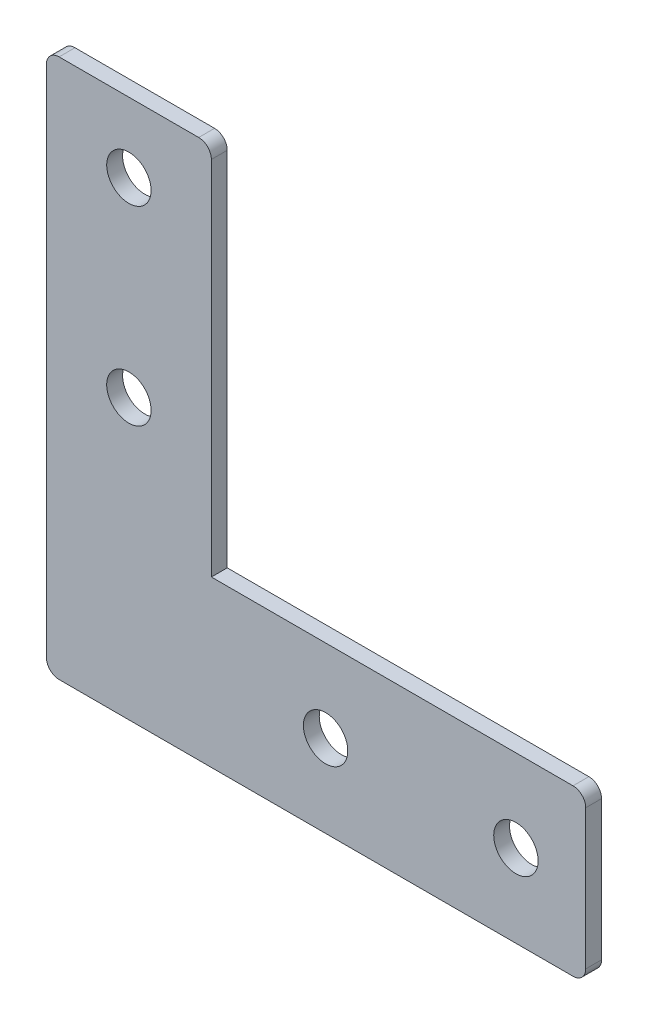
ISO-10303-21;
HEADER;
FILE_DESCRIPTION(('STEP AP214'),'2;1');
FILE_NAME('part.step','',(''),(''),'','','');
FILE_SCHEMA(('AUTOMOTIVE_DESIGN { 1 0 10303 214 1 1 1 1 }'));
ENDSEC;
DATA;
#1=APPLICATION_CONTEXT('core data for automotive mechanical design processes');
#2=APPLICATION_PROTOCOL_DEFINITION('international standard','automotive_design',2000,#1);
#3=PRODUCT_CONTEXT('',#1,'mechanical');
#4=PRODUCT('Part','Part','',(#3));
#5=PRODUCT_RELATED_PRODUCT_CATEGORY('part','',(#4));
#6=PRODUCT_DEFINITION_FORMATION('','',#4);
#7=PRODUCT_DEFINITION_CONTEXT('part definition',#1,'design');
#8=PRODUCT_DEFINITION('design','',#6,#7);
#9=PRODUCT_DEFINITION_SHAPE('','',#8);
#10=(LENGTH_UNIT() NAMED_UNIT(*) SI_UNIT(.MILLI.,.METRE.));
#11=(NAMED_UNIT(*) PLANE_ANGLE_UNIT() SI_UNIT($,.RADIAN.));
#12=(NAMED_UNIT(*) SI_UNIT($,.STERADIAN.) SOLID_ANGLE_UNIT());
#13=UNCERTAINTY_MEASURE_WITH_UNIT(LENGTH_MEASURE(1.E-05),#10,'distance_accuracy_value','');
#14=(GEOMETRIC_REPRESENTATION_CONTEXT(3) GLOBAL_UNCERTAINTY_ASSIGNED_CONTEXT((#13)) GLOBAL_UNIT_ASSIGNED_CONTEXT((#10,
#11,#12)) REPRESENTATION_CONTEXT('',''));
#15=CARTESIAN_POINT('',(0.,0.,0.));
#16=DIRECTION('',(0.,0.,1.));
#17=DIRECTION('',(1.,0.,0.));
#18=AXIS2_PLACEMENT_3D('',#15,#16,#17);
#19=CARTESIAN_POINT('',(0.,0.,1.25));
#20=DIRECTION('',(0.,0.,1.));
#21=DIRECTION('',(1.,0.,0.));
#22=AXIS2_PLACEMENT_3D('',#19,#20,#21);
#23=PLANE('',#22);
#24=CARTESIAN_POINT('',(44.,13.,1.25));
#25=DIRECTION('',(0.,0.,1.));
#26=DIRECTION('',(-1.,0.,0.));
#27=AXIS2_PLACEMENT_3D('',#24,#25,#26);
#28=CIRCLE('',#27,3.5);
#29=CARTESIAN_POINT('',(40.5,13.,1.25));
#30=VERTEX_POINT('',#29);
#31=EDGE_CURVE('E399',#30,#30,#28,.T.);
#32=ORIENTED_EDGE('',*,*,#31,.F.);
#33=EDGE_LOOP('',(#32));
#34=FACE_BOUND('',#33,.T.);
#35=CARTESIAN_POINT('',(13.,74.,1.25));
#36=DIRECTION('',(0.,0.,1.));
#37=DIRECTION('',(1.,0.,0.));
#38=AXIS2_PLACEMENT_3D('',#35,#36,#37);
#39=CIRCLE('',#38,3.5);
#40=CARTESIAN_POINT('',(16.5,74.,1.25));
#41=VERTEX_POINT('',#40);
#42=EDGE_CURVE('E150',#41,#41,#39,.T.);
#43=ORIENTED_EDGE('',*,*,#42,.F.);
#44=EDGE_LOOP('',(#43));
#45=FACE_BOUND('',#44,.T.);
#46=DIRECTION('',(1.,0.,0.));
#47=VECTOR('',#46,1.);
#48=CARTESIAN_POINT('',(0.,0.,1.25));
#49=LINE('',#48,#47);
#50=CARTESIAN_POINT('',(2.,0.,1.25));
#51=VERTEX_POINT('',#50);
#52=CARTESIAN_POINT('',(83.,0.,1.25));
#53=VERTEX_POINT('',#52);
#54=EDGE_CURVE('E217',#51,#53,#49,.T.);
#55=ORIENTED_EDGE('',*,*,#54,.T.);
#56=CARTESIAN_POINT('',(83.,2.,1.25));
#57=DIRECTION('',(0.,0.,1.));
#58=DIRECTION('',(1.,0.,0.));
#59=AXIS2_PLACEMENT_3D('',#56,#57,#58);
#60=CIRCLE('',#59,2.);
#61=CARTESIAN_POINT('',(85.,2.,1.25));
#62=VERTEX_POINT('',#61);
#63=EDGE_CURVE('E187',#53,#62,#60,.T.);
#64=ORIENTED_EDGE('',*,*,#63,.T.);
#65=DIRECTION('',(0.,1.,0.));
#66=VECTOR('',#65,1.);
#67=CARTESIAN_POINT('',(85.,0.,1.25));
#68=LINE('',#67,#66);
#69=CARTESIAN_POINT('',(85.,24.,1.25));
#70=VERTEX_POINT('',#69);
#71=EDGE_CURVE('E127',#62,#70,#68,.T.);
#72=ORIENTED_EDGE('',*,*,#71,.T.);
#73=CARTESIAN_POINT('',(83.,24.,1.25));
#74=DIRECTION('',(0.,0.,1.));
#75=DIRECTION('',(1.,0.,0.));
#76=AXIS2_PLACEMENT_3D('',#73,#74,#75);
#77=CIRCLE('',#76,2.);
#78=CARTESIAN_POINT('',(83.,26.,1.25));
#79=VERTEX_POINT('',#78);
#80=EDGE_CURVE('E123',#70,#79,#77,.T.);
#81=ORIENTED_EDGE('',*,*,#80,.T.);
#82=DIRECTION('',(-1.,0.,0.));
#83=VECTOR('',#82,1.);
#84=CARTESIAN_POINT('',(85.,26.,1.25));
#85=LINE('',#84,#83);
#86=CARTESIAN_POINT('',(26.,26.,1.25));
#87=VERTEX_POINT('',#86);
#88=EDGE_CURVE('E115',#79,#87,#85,.T.);
#89=ORIENTED_EDGE('',*,*,#88,.T.);
#90=DIRECTION('',(0.,1.,0.));
#91=VECTOR('',#90,1.);
#92=CARTESIAN_POINT('',(26.,26.,1.25));
#93=LINE('',#92,#91);
#94=CARTESIAN_POINT('',(26.,83.,1.25));
#95=VERTEX_POINT('',#94);
#96=EDGE_CURVE('E120',#87,#95,#93,.T.);
#97=ORIENTED_EDGE('',*,*,#96,.T.);
#98=CARTESIAN_POINT('',(24.,83.,1.25));
#99=DIRECTION('',(0.,0.,1.));
#100=DIRECTION('',(1.,0.,0.));
#101=AXIS2_PLACEMENT_3D('',#98,#99,#100);
#102=CIRCLE('',#101,2.);
#103=CARTESIAN_POINT('',(24.,85.,1.25));
#104=VERTEX_POINT('',#103);
#105=EDGE_CURVE('E55',#95,#104,#102,.T.);
#106=ORIENTED_EDGE('',*,*,#105,.T.);
#107=DIRECTION('',(-1.,0.,0.));
#108=VECTOR('',#107,1.);
#109=CARTESIAN_POINT('',(26.,85.,1.25));
#110=LINE('',#109,#108);
#111=CARTESIAN_POINT('',(2.,85.,1.25));
#112=VERTEX_POINT('',#111);
#113=EDGE_CURVE('E138',#104,#112,#110,.T.);
#114=ORIENTED_EDGE('',*,*,#113,.T.);
#115=CARTESIAN_POINT('',(2.,83.,1.25));
#116=DIRECTION('',(0.,0.,1.));
#117=DIRECTION('',(1.,0.,0.));
#118=AXIS2_PLACEMENT_3D('',#115,#116,#117);
#119=CIRCLE('',#118,2.);
#120=CARTESIAN_POINT('',(0.,83.,1.25));
#121=VERTEX_POINT('',#120);
#122=EDGE_CURVE('E182',#112,#121,#119,.T.);
#123=ORIENTED_EDGE('',*,*,#122,.T.);
#124=DIRECTION('',(0.,-1.,0.));
#125=VECTOR('',#124,1.);
#126=CARTESIAN_POINT('',(0.,85.,1.25));
#127=LINE('',#126,#125);
#128=CARTESIAN_POINT('',(0.,2.,1.25));
#129=VERTEX_POINT('',#128);
#130=EDGE_CURVE('E160',#121,#129,#127,.T.);
#131=ORIENTED_EDGE('',*,*,#130,.T.);
#132=CARTESIAN_POINT('',(2.,2.,1.25));
#133=DIRECTION('',(0.,0.,1.));
#134=DIRECTION('',(1.,0.,0.));
#135=AXIS2_PLACEMENT_3D('',#132,#133,#134);
#136=CIRCLE('',#135,2.);
#137=EDGE_CURVE('E184',#129,#51,#136,.T.);
#138=ORIENTED_EDGE('',*,*,#137,.T.);
#139=EDGE_LOOP('',(#55,#64,#72,#81,#89,#97,#106,#114,#123,#131,#138));
#140=FACE_BOUND('',#139,.T.);
#141=CARTESIAN_POINT('',(13.,44.,1.25));
#142=DIRECTION('',(0.,0.,1.));
#143=DIRECTION('',(1.,0.,0.));
#144=AXIS2_PLACEMENT_3D('',#141,#142,#143);
#145=CIRCLE('',#144,3.5);
#146=CARTESIAN_POINT('',(16.5,44.,1.25));
#147=VERTEX_POINT('',#146);
#148=EDGE_CURVE('E393',#147,#147,#145,.T.);
#149=ORIENTED_EDGE('',*,*,#148,.F.);
#150=EDGE_LOOP('',(#149));
#151=FACE_BOUND('',#150,.T.);
#152=CARTESIAN_POINT('',(74.,13.,1.25));
#153=DIRECTION('',(0.,0.,1.));
#154=DIRECTION('',(-1.,0.,0.));
#155=AXIS2_PLACEMENT_3D('',#152,#153,#154);
#156=CIRCLE('',#155,3.50000000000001);
#157=CARTESIAN_POINT('',(70.5,13.,1.25));
#158=VERTEX_POINT('',#157);
#159=EDGE_CURVE('E405',#158,#158,#156,.T.);
#160=ORIENTED_EDGE('',*,*,#159,.F.);
#161=EDGE_LOOP('',(#160));
#162=FACE_BOUND('',#161,.T.);
#163=ADVANCED_FACE('F34',(#34,#45,#140,#151,#162),#23,.T.);
#164=CARTESIAN_POINT('',(0.,0.,-1.25));
#165=DIRECTION('',(0.,0.,1.));
#166=DIRECTION('',(1.,0.,0.));
#167=AXIS2_PLACEMENT_3D('',#164,#165,#166);
#168=PLANE('',#167);
#169=CARTESIAN_POINT('',(44.,13.,-1.25));
#170=DIRECTION('',(0.,0.,1.));
#171=DIRECTION('',(-1.,0.,0.));
#172=AXIS2_PLACEMENT_3D('',#169,#170,#171);
#173=CIRCLE('',#172,3.5);
#174=CARTESIAN_POINT('',(40.5,13.,-1.25));
#175=VERTEX_POINT('',#174);
#176=EDGE_CURVE('E402',#175,#175,#173,.T.);
#177=ORIENTED_EDGE('',*,*,#176,.T.);
#178=EDGE_LOOP('',(#177));
#179=FACE_BOUND('',#178,.T.);
#180=CARTESIAN_POINT('',(13.,74.,-1.25));
#181=DIRECTION('',(0.,0.,1.));
#182=DIRECTION('',(1.,0.,0.));
#183=AXIS2_PLACEMENT_3D('',#180,#181,#182);
#184=CIRCLE('',#183,3.5);
#185=CARTESIAN_POINT('',(16.5,74.,-1.25));
#186=VERTEX_POINT('',#185);
#187=EDGE_CURVE('E221',#186,#186,#184,.T.);
#188=ORIENTED_EDGE('',*,*,#187,.T.);
#189=EDGE_LOOP('',(#188));
#190=FACE_BOUND('',#189,.T.);
#191=DIRECTION('',(0.,1.,0.));
#192=VECTOR('',#191,1.);
#193=CARTESIAN_POINT('',(85.,0.,-1.25));
#194=LINE('',#193,#192);
#195=CARTESIAN_POINT('',(85.,2.,-1.25));
#196=VERTEX_POINT('',#195);
#197=CARTESIAN_POINT('',(85.,24.,-1.25));
#198=VERTEX_POINT('',#197);
#199=EDGE_CURVE('E153',#196,#198,#194,.T.);
#200=ORIENTED_EDGE('',*,*,#199,.F.);
#201=CARTESIAN_POINT('',(83.,2.,-1.25));
#202=DIRECTION('',(0.,0.,1.));
#203=DIRECTION('',(1.,0.,0.));
#204=AXIS2_PLACEMENT_3D('',#201,#202,#203);
#205=CIRCLE('',#204,2.);
#206=CARTESIAN_POINT('',(83.,0.,-1.25));
#207=VERTEX_POINT('',#206);
#208=EDGE_CURVE('E174',#196,#207,#205,.F.);
#209=ORIENTED_EDGE('',*,*,#208,.T.);
#210=DIRECTION('',(1.,0.,0.));
#211=VECTOR('',#210,1.);
#212=CARTESIAN_POINT('',(0.,0.,-1.25));
#213=LINE('',#212,#211);
#214=CARTESIAN_POINT('',(2.,0.,-1.25));
#215=VERTEX_POINT('',#214);
#216=EDGE_CURVE('E149',#215,#207,#213,.T.);
#217=ORIENTED_EDGE('',*,*,#216,.F.);
#218=CARTESIAN_POINT('',(2.,2.,-1.25));
#219=DIRECTION('',(0.,0.,1.));
#220=DIRECTION('',(1.,0.,0.));
#221=AXIS2_PLACEMENT_3D('',#218,#219,#220);
#222=CIRCLE('',#221,2.);
#223=CARTESIAN_POINT('',(0.,2.,-1.25));
#224=VERTEX_POINT('',#223);
#225=EDGE_CURVE('E170',#215,#224,#222,.F.);
#226=ORIENTED_EDGE('',*,*,#225,.T.);
#227=DIRECTION('',(0.,-1.,0.));
#228=VECTOR('',#227,1.);
#229=CARTESIAN_POINT('',(0.,85.,-1.25));
#230=LINE('',#229,#228);
#231=CARTESIAN_POINT('',(0.,83.,-1.25));
#232=VERTEX_POINT('',#231);
#233=EDGE_CURVE('E146',#232,#224,#230,.T.);
#234=ORIENTED_EDGE('',*,*,#233,.F.);
#235=CARTESIAN_POINT('',(2.,83.,-1.25));
#236=DIRECTION('',(0.,0.,1.));
#237=DIRECTION('',(1.,0.,0.));
#238=AXIS2_PLACEMENT_3D('',#235,#236,#237);
#239=CIRCLE('',#238,2.);
#240=CARTESIAN_POINT('',(2.,85.,-1.25));
#241=VERTEX_POINT('',#240);
#242=EDGE_CURVE('E168',#232,#241,#239,.F.);
#243=ORIENTED_EDGE('',*,*,#242,.T.);
#244=DIRECTION('',(-1.,0.,0.));
#245=VECTOR('',#244,1.);
#246=CARTESIAN_POINT('',(26.,85.,-1.25));
#247=LINE('',#246,#245);
#248=CARTESIAN_POINT('',(24.,85.,-1.25));
#249=VERTEX_POINT('',#248);
#250=EDGE_CURVE('E159',#249,#241,#247,.T.);
#251=ORIENTED_EDGE('',*,*,#250,.F.);
#252=CARTESIAN_POINT('',(24.,83.,-1.25));
#253=DIRECTION('',(0.,0.,1.));
#254=DIRECTION('',(1.,0.,0.));
#255=AXIS2_PLACEMENT_3D('',#252,#253,#254);
#256=CIRCLE('',#255,2.);
#257=CARTESIAN_POINT('',(26.,83.,-1.25));
#258=VERTEX_POINT('',#257);
#259=EDGE_CURVE('E166',#249,#258,#256,.F.);
#260=ORIENTED_EDGE('',*,*,#259,.T.);
#261=DIRECTION('',(0.,1.,0.));
#262=VECTOR('',#261,1.);
#263=CARTESIAN_POINT('',(26.,26.,-1.25));
#264=LINE('',#263,#262);
#265=CARTESIAN_POINT('',(26.,26.,-1.25));
#266=VERTEX_POINT('',#265);
#267=EDGE_CURVE('E157',#266,#258,#264,.T.);
#268=ORIENTED_EDGE('',*,*,#267,.F.);
#269=DIRECTION('',(-1.,0.,0.));
#270=VECTOR('',#269,1.);
#271=CARTESIAN_POINT('',(85.,26.,-1.25));
#272=LINE('',#271,#270);
#273=CARTESIAN_POINT('',(83.,26.,-1.25));
#274=VERTEX_POINT('',#273);
#275=EDGE_CURVE('E133',#274,#266,#272,.T.);
#276=ORIENTED_EDGE('',*,*,#275,.F.);
#277=CARTESIAN_POINT('',(83.,24.,-1.25));
#278=DIRECTION('',(0.,0.,1.));
#279=DIRECTION('',(1.,0.,0.));
#280=AXIS2_PLACEMENT_3D('',#277,#278,#279);
#281=CIRCLE('',#280,2.);
#282=EDGE_CURVE('E172',#274,#198,#281,.F.);
#283=ORIENTED_EDGE('',*,*,#282,.T.);
#284=EDGE_LOOP('',(#200,#209,#217,#226,#234,#243,#251,#260,#268,#276,#283));
#285=FACE_BOUND('',#284,.T.);
#286=CARTESIAN_POINT('',(13.,44.,-1.25));
#287=DIRECTION('',(0.,0.,1.));
#288=DIRECTION('',(1.,0.,0.));
#289=AXIS2_PLACEMENT_3D('',#286,#287,#288);
#290=CIRCLE('',#289,3.5);
#291=CARTESIAN_POINT('',(16.5,44.,-1.25));
#292=VERTEX_POINT('',#291);
#293=EDGE_CURVE('E395',#292,#292,#290,.T.);
#294=ORIENTED_EDGE('',*,*,#293,.T.);
#295=EDGE_LOOP('',(#294));
#296=FACE_BOUND('',#295,.T.);
#297=CARTESIAN_POINT('',(74.,13.,-1.25));
#298=DIRECTION('',(0.,0.,1.));
#299=DIRECTION('',(-1.,0.,0.));
#300=AXIS2_PLACEMENT_3D('',#297,#298,#299);
#301=CIRCLE('',#300,3.50000000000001);
#302=CARTESIAN_POINT('',(70.5,13.,-1.25));
#303=VERTEX_POINT('',#302);
#304=EDGE_CURVE('E408',#303,#303,#301,.T.);
#305=ORIENTED_EDGE('',*,*,#304,.T.);
#306=EDGE_LOOP('',(#305));
#307=FACE_BOUND('',#306,.T.);
#308=ADVANCED_FACE('F204',(#179,#190,#285,#296,#307),#168,.F.);
#309=CARTESIAN_POINT('',(0.,85.,1.25));
#310=DIRECTION('',(1.,0.,0.));
#311=DIRECTION('',(0.,1.,0.));
#312=AXIS2_PLACEMENT_3D('',#309,#310,#311);
#313=PLANE('',#312);
#314=ORIENTED_EDGE('',*,*,#233,.T.);
#315=DIRECTION('',(0.,0.,-1.));
#316=VECTOR('',#315,1.);
#317=CARTESIAN_POINT('',(0.,2.,1.25));
#318=LINE('',#317,#316);
#319=EDGE_CURVE('E194',#224,#129,#318,.F.);
#320=ORIENTED_EDGE('',*,*,#319,.T.);
#321=ORIENTED_EDGE('',*,*,#130,.F.);
#322=DIRECTION('',(0.,0.,-1.));
#323=VECTOR('',#322,1.);
#324=CARTESIAN_POINT('',(0.,83.,1.25));
#325=LINE('',#324,#323);
#326=EDGE_CURVE('E191',#121,#232,#325,.T.);
#327=ORIENTED_EDGE('',*,*,#326,.T.);
#328=EDGE_LOOP('',(#314,#320,#321,#327));
#329=FACE_BOUND('',#328,.T.);
#330=ADVANCED_FACE('F213',(#329),#313,.F.);
#331=CARTESIAN_POINT('',(0.,0.,1.25));
#332=DIRECTION('',(0.,1.,0.));
#333=DIRECTION('',(0.,0.,1.));
#334=AXIS2_PLACEMENT_3D('',#331,#332,#333);
#335=PLANE('',#334);
#336=ORIENTED_EDGE('',*,*,#216,.T.);
#337=DIRECTION('',(0.,0.,-1.));
#338=VECTOR('',#337,1.);
#339=CARTESIAN_POINT('',(83.,0.,1.25));
#340=LINE('',#339,#338);
#341=EDGE_CURVE('E179',#207,#53,#340,.F.);
#342=ORIENTED_EDGE('',*,*,#341,.T.);
#343=ORIENTED_EDGE('',*,*,#54,.F.);
#344=DIRECTION('',(0.,0.,-1.));
#345=VECTOR('',#344,1.);
#346=CARTESIAN_POINT('',(2.,0.,1.25));
#347=LINE('',#346,#345);
#348=EDGE_CURVE('E176',#51,#215,#347,.T.);
#349=ORIENTED_EDGE('',*,*,#348,.T.);
#350=EDGE_LOOP('',(#336,#342,#343,#349));
#351=FACE_BOUND('',#350,.T.);
#352=ADVANCED_FACE('F259',(#351),#335,.F.);
#353=CARTESIAN_POINT('',(85.,0.,1.25));
#354=DIRECTION('',(-1.,0.,0.));
#355=DIRECTION('',(0.,0.,1.));
#356=AXIS2_PLACEMENT_3D('',#353,#354,#355);
#357=PLANE('',#356);
#358=ORIENTED_EDGE('',*,*,#71,.F.);
#359=DIRECTION('',(0.,0.,-1.));
#360=VECTOR('',#359,1.);
#361=CARTESIAN_POINT('',(85.,2.,1.25));
#362=LINE('',#361,#360);
#363=EDGE_CURVE('E163',#62,#196,#362,.T.);
#364=ORIENTED_EDGE('',*,*,#363,.T.);
#365=ORIENTED_EDGE('',*,*,#199,.T.);
#366=DIRECTION('',(0.,0.,-1.));
#367=VECTOR('',#366,1.);
#368=CARTESIAN_POINT('',(85.,24.,1.25));
#369=LINE('',#368,#367);
#370=EDGE_CURVE('E137',#198,#70,#369,.F.);
#371=ORIENTED_EDGE('',*,*,#370,.T.);
#372=EDGE_LOOP('',(#358,#364,#365,#371));
#373=FACE_BOUND('',#372,.T.);
#374=ADVANCED_FACE('F256',(#373),#357,.F.);
#375=CARTESIAN_POINT('',(85.,26.,1.25));
#376=DIRECTION('',(0.,-1.,0.));
#377=DIRECTION('',(1.,0.,0.));
#378=AXIS2_PLACEMENT_3D('',#375,#376,#377);
#379=PLANE('',#378);
#380=ORIENTED_EDGE('',*,*,#88,.F.);
#381=DIRECTION('',(0.,0.,-1.));
#382=VECTOR('',#381,1.);
#383=CARTESIAN_POINT('',(83.,26.,1.25));
#384=LINE('',#383,#382);
#385=EDGE_CURVE('E189',#79,#274,#384,.T.);
#386=ORIENTED_EDGE('',*,*,#385,.T.);
#387=ORIENTED_EDGE('',*,*,#275,.T.);
#388=DIRECTION('',(0.,0.,-1.));
#389=VECTOR('',#388,1.);
#390=CARTESIAN_POINT('',(26.,26.,1.25));
#391=LINE('',#390,#389);
#392=EDGE_CURVE('E130',#87,#266,#391,.T.);
#393=ORIENTED_EDGE('',*,*,#392,.F.);
#394=EDGE_LOOP('',(#380,#386,#387,#393));
#395=FACE_BOUND('',#394,.T.);
#396=ADVANCED_FACE('F131',(#395),#379,.F.);
#397=CARTESIAN_POINT('',(26.,26.,1.25));
#398=DIRECTION('',(-1.,0.,0.));
#399=DIRECTION('',(0.,-1.,0.));
#400=AXIS2_PLACEMENT_3D('',#397,#398,#399);
#401=PLANE('',#400);
#402=ORIENTED_EDGE('',*,*,#267,.T.);
#403=DIRECTION('',(0.,0.,-1.));
#404=VECTOR('',#403,1.);
#405=CARTESIAN_POINT('',(26.,83.,1.25));
#406=LINE('',#405,#404);
#407=EDGE_CURVE('E11',#258,#95,#406,.F.);
#408=ORIENTED_EDGE('',*,*,#407,.T.);
#409=ORIENTED_EDGE('',*,*,#96,.F.);
#410=ORIENTED_EDGE('',*,*,#392,.T.);
#411=EDGE_LOOP('',(#402,#408,#409,#410));
#412=FACE_BOUND('',#411,.T.);
#413=ADVANCED_FACE('F140',(#412),#401,.F.);
#414=CARTESIAN_POINT('',(26.,85.,1.25));
#415=DIRECTION('',(0.,-1.,0.));
#416=DIRECTION('',(0.,0.,-1.));
#417=AXIS2_PLACEMENT_3D('',#414,#415,#416);
#418=PLANE('',#417);
#419=ORIENTED_EDGE('',*,*,#250,.T.);
#420=DIRECTION('',(0.,0.,-1.));
#421=VECTOR('',#420,1.);
#422=CARTESIAN_POINT('',(2.,85.,1.25));
#423=LINE('',#422,#421);
#424=EDGE_CURVE('E42',#241,#112,#423,.F.);
#425=ORIENTED_EDGE('',*,*,#424,.T.);
#426=ORIENTED_EDGE('',*,*,#113,.F.);
#427=DIRECTION('',(0.,0.,-1.));
#428=VECTOR('',#427,1.);
#429=CARTESIAN_POINT('',(24.,85.,1.25));
#430=LINE('',#429,#428);
#431=EDGE_CURVE('E196',#104,#249,#430,.T.);
#432=ORIENTED_EDGE('',*,*,#431,.T.);
#433=EDGE_LOOP('',(#419,#425,#426,#432));
#434=FACE_BOUND('',#433,.T.);
#435=ADVANCED_FACE('F200',(#434),#418,.F.);
#436=CARTESIAN_POINT('',(13.,74.,1.25));
#437=DIRECTION('',(0.,0.,-1.));
#438=DIRECTION('',(-1.,0.,0.));
#439=AXIS2_PLACEMENT_3D('',#436,#437,#438);
#440=CYLINDRICAL_SURFACE('',#439,3.5);
#441=ORIENTED_EDGE('',*,*,#42,.T.);
#442=EDGE_LOOP('',(#441));
#443=FACE_BOUND('',#442,.T.);
#444=ORIENTED_EDGE('',*,*,#187,.F.);
#445=EDGE_LOOP('',(#444));
#446=FACE_BOUND('',#445,.T.);
#447=ADVANCED_FACE('F247',(#443,#446),#440,.F.);
#448=CARTESIAN_POINT('',(13.,44.,1.25));
#449=DIRECTION('',(0.,0.,-1.));
#450=DIRECTION('',(-1.,0.,0.));
#451=AXIS2_PLACEMENT_3D('',#448,#449,#450);
#452=CYLINDRICAL_SURFACE('',#451,3.5);
#453=ORIENTED_EDGE('',*,*,#148,.T.);
#454=EDGE_LOOP('',(#453));
#455=FACE_BOUND('',#454,.T.);
#456=ORIENTED_EDGE('',*,*,#293,.F.);
#457=EDGE_LOOP('',(#456));
#458=FACE_BOUND('',#457,.T.);
#459=ADVANCED_FACE('F319',(#455,#458),#452,.F.);
#460=CARTESIAN_POINT('',(44.,13.,1.25));
#461=DIRECTION('',(0.,0.,-1.));
#462=DIRECTION('',(-1.,0.,0.));
#463=AXIS2_PLACEMENT_3D('',#460,#461,#462);
#464=CYLINDRICAL_SURFACE('',#463,3.5);
#465=ORIENTED_EDGE('',*,*,#31,.T.);
#466=EDGE_LOOP('',(#465));
#467=FACE_BOUND('',#466,.T.);
#468=ORIENTED_EDGE('',*,*,#176,.F.);
#469=EDGE_LOOP('',(#468));
#470=FACE_BOUND('',#469,.T.);
#471=ADVANCED_FACE('F310',(#467,#470),#464,.F.);
#472=CARTESIAN_POINT('',(74.,13.,1.25));
#473=DIRECTION('',(0.,0.,-1.));
#474=DIRECTION('',(-1.,0.,0.));
#475=AXIS2_PLACEMENT_3D('',#472,#473,#474);
#476=CYLINDRICAL_SURFACE('',#475,3.50000000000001);
#477=ORIENTED_EDGE('',*,*,#159,.T.);
#478=EDGE_LOOP('',(#477));
#479=FACE_BOUND('',#478,.T.);
#480=ORIENTED_EDGE('',*,*,#304,.F.);
#481=EDGE_LOOP('',(#480));
#482=FACE_BOUND('',#481,.T.);
#483=ADVANCED_FACE('F268',(#479,#482),#476,.F.);
#484=CARTESIAN_POINT('',(83.,2.,1.25));
#485=DIRECTION('',(0.,0.,-1.));
#486=DIRECTION('',(-1.,0.,0.));
#487=AXIS2_PLACEMENT_3D('',#484,#485,#486);
#488=CYLINDRICAL_SURFACE('',#487,2.);
#489=ORIENTED_EDGE('',*,*,#63,.F.);
#490=ORIENTED_EDGE('',*,*,#341,.F.);
#491=ORIENTED_EDGE('',*,*,#208,.F.);
#492=ORIENTED_EDGE('',*,*,#363,.F.);
#493=EDGE_LOOP('',(#489,#490,#491,#492));
#494=FACE_BOUND('',#493,.T.);
#495=ADVANCED_FACE('F265',(#494),#488,.T.);
#496=CARTESIAN_POINT('',(83.,24.,1.25));
#497=DIRECTION('',(0.,0.,-1.));
#498=DIRECTION('',(-1.,0.,0.));
#499=AXIS2_PLACEMENT_3D('',#496,#497,#498);
#500=CYLINDRICAL_SURFACE('',#499,2.);
#501=ORIENTED_EDGE('',*,*,#80,.F.);
#502=ORIENTED_EDGE('',*,*,#370,.F.);
#503=ORIENTED_EDGE('',*,*,#282,.F.);
#504=ORIENTED_EDGE('',*,*,#385,.F.);
#505=EDGE_LOOP('',(#501,#502,#503,#504));
#506=FACE_BOUND('',#505,.T.);
#507=ADVANCED_FACE('F229',(#506),#500,.T.);
#508=CARTESIAN_POINT('',(2.,2.,1.25));
#509=DIRECTION('',(0.,0.,-1.));
#510=DIRECTION('',(-1.,0.,0.));
#511=AXIS2_PLACEMENT_3D('',#508,#509,#510);
#512=CYLINDRICAL_SURFACE('',#511,2.);
#513=ORIENTED_EDGE('',*,*,#137,.F.);
#514=ORIENTED_EDGE('',*,*,#319,.F.);
#515=ORIENTED_EDGE('',*,*,#225,.F.);
#516=ORIENTED_EDGE('',*,*,#348,.F.);
#517=EDGE_LOOP('',(#513,#514,#515,#516));
#518=FACE_BOUND('',#517,.T.);
#519=ADVANCED_FACE('F234',(#518),#512,.T.);
#520=CARTESIAN_POINT('',(2.,83.,1.25));
#521=DIRECTION('',(0.,0.,-1.));
#522=DIRECTION('',(-1.,0.,0.));
#523=AXIS2_PLACEMENT_3D('',#520,#521,#522);
#524=CYLINDRICAL_SURFACE('',#523,2.);
#525=ORIENTED_EDGE('',*,*,#122,.F.);
#526=ORIENTED_EDGE('',*,*,#424,.F.);
#527=ORIENTED_EDGE('',*,*,#242,.F.);
#528=ORIENTED_EDGE('',*,*,#326,.F.);
#529=EDGE_LOOP('',(#525,#526,#527,#528));
#530=FACE_BOUND('',#529,.T.);
#531=ADVANCED_FACE('F210',(#530),#524,.T.);
#532=CARTESIAN_POINT('',(24.,83.,1.25));
#533=DIRECTION('',(0.,0.,-1.));
#534=DIRECTION('',(-1.,0.,0.));
#535=AXIS2_PLACEMENT_3D('',#532,#533,#534);
#536=CYLINDRICAL_SURFACE('',#535,2.);
#537=ORIENTED_EDGE('',*,*,#105,.F.);
#538=ORIENTED_EDGE('',*,*,#407,.F.);
#539=ORIENTED_EDGE('',*,*,#259,.F.);
#540=ORIENTED_EDGE('',*,*,#431,.F.);
#541=EDGE_LOOP('',(#537,#538,#539,#540));
#542=FACE_BOUND('',#541,.T.);
#543=ADVANCED_FACE('F36',(#542),#536,.T.);
#544=CLOSED_SHELL('',(#163,#308,#330,#352,#374,#396,#413,#435,#447,#459,#471,#483,#495,#507,
#519,#531,#543));
#545=MANIFOLD_SOLID_BREP('B2',#544);
#546=ADVANCED_BREP_SHAPE_REPRESENTATION('',(#18,#545),#14);
#547=SHAPE_DEFINITION_REPRESENTATION(#9,#546);
ENDSEC;
END-ISO-10303-21;
